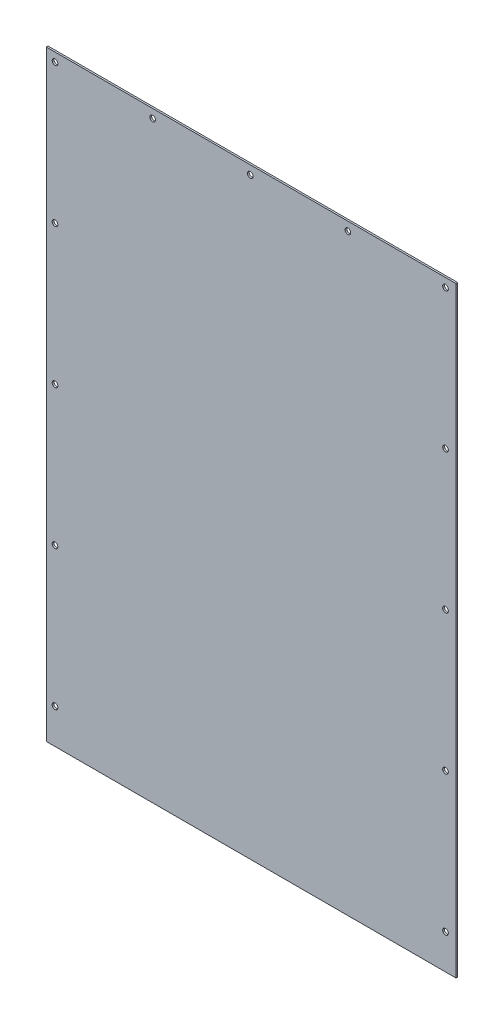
from build123d import *

# Parameters (mm, degrees)
ESQUISSE1_W                     = 470
ESQUISSE1_H                     = 690
BOSS_EXTRU_1_DEPTH              = 2
ESQUISSE2_R                     = 3.25
ENL_V_MAT_EXTRU_1_DEPTH         = 835.867654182
R_P_TITION_LIN_AIRE1_COUNT      = 5
R_P_TITION_LIN_AIRE1_PITCH      = 112
R_P_TITION_LIN_AIRE1_COUNT_DIR2 = 5
R_P_TITION_LIN_AIRE1_PITCH_DIR2 = 160


with BuildPart() as part:
    # Esquisse1 → Boss.-Extru.1 (new body)
    with BuildSketch(Plane.XY):
        with Locations((235, 345)):
            Rectangle(ESQUISSE1_W, ESQUISSE1_H)
    extrude(amount=BOSS_EXTRU_1_DEPTH)

    # Esquisse2 → Enl_v. mat.-Extru.1 (cut, through all)
    with BuildSketch(Plane.XY.offset(2)):
        with Locations((10, 680)):
            Circle(ESQUISSE2_R)
    enl_v_mat_extru_1 = extrude(amount=-ENL_V_MAT_EXTRU_1_DEPTH, mode=Mode.SUBTRACT)

    # R_p_tition lin_aire1: Enl_v. mat.-Extru.1 5 × 5, 12 skipped
    with Locations(*[(i * R_P_TITION_LIN_AIRE1_PITCH, -j * R_P_TITION_LIN_AIRE1_PITCH_DIR2, 0) for i in range(R_P_TITION_LIN_AIRE1_COUNT) for j in range(R_P_TITION_LIN_AIRE1_COUNT_DIR2) if (i, j) not in ((0, 0), (1, 1), (1, 2), (1, 3), (1, 4), (2, 1), (2, 2), (2, 3), (2, 4), (3, 1), (3, 2), (3, 3), (3, 4))]):
        add(enl_v_mat_extru_1, mode=Mode.SUBTRACT)


solid = part.part
